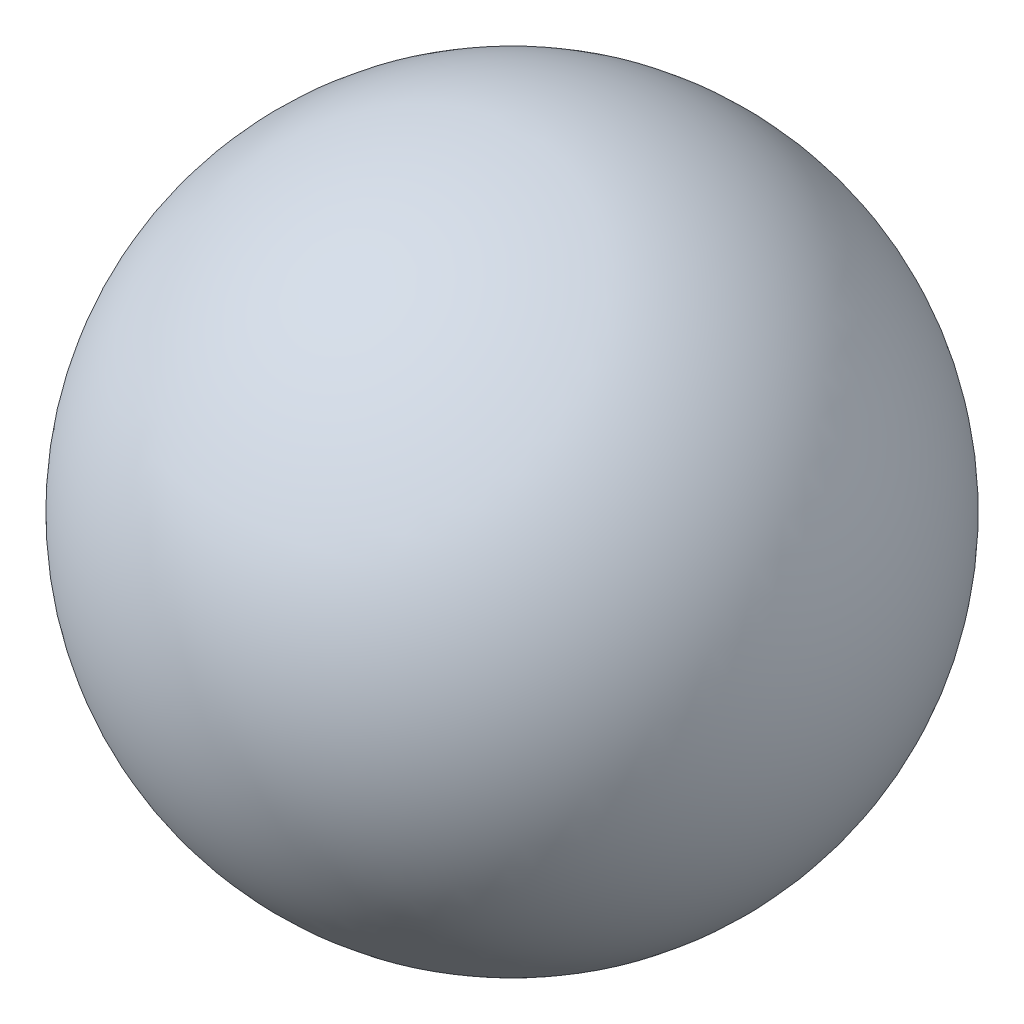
from build123d import *


with BuildPart() as part:
    # Sketch1 → Revolve1 (revolve)
    with BuildSketch(Plane.XY):
        with BuildLine():
            Line((0, 19.685), (0, -19.685))
            ThreePointArc((0, -19.685), (19.685, 0), (0, 19.685))
        make_face()
    revolve(axis=Axis((0, 21.6535, 0), (0, -1, 0)))


solid = part.part
